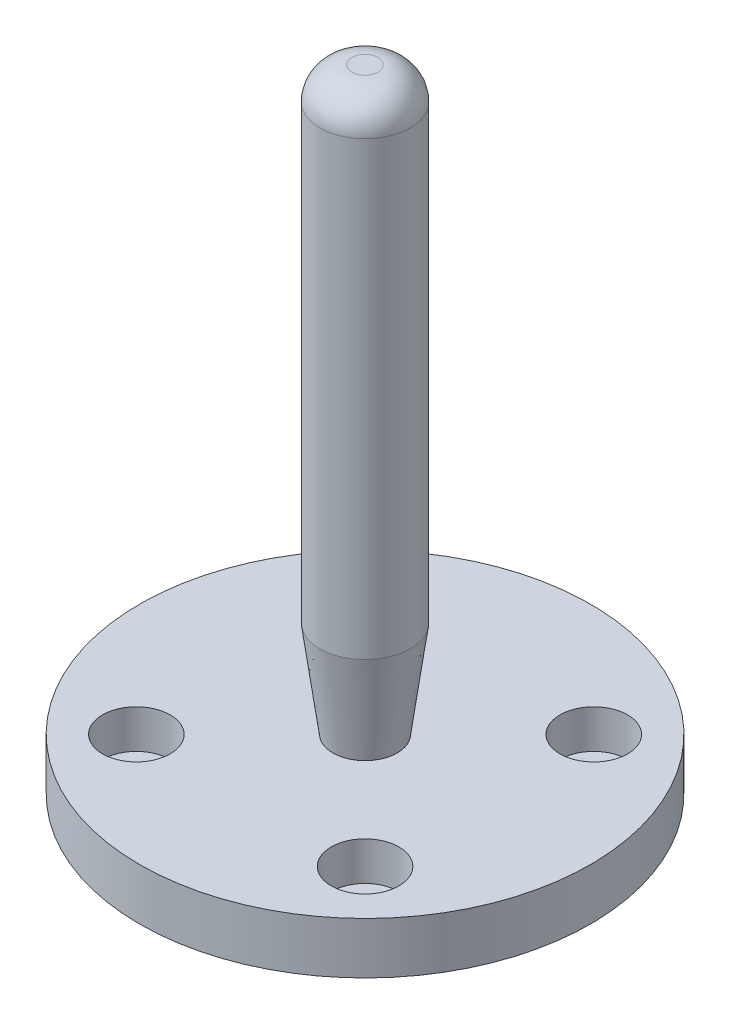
from build123d import *

# Parameters (mm, degrees)
SKETCH1_R           = 35
BOSS_EXTRUDE1_DEPTH = 8
SKETCH2_R           = 5.25
CUT_EXTRUDE1_DEPTH  = 6
SKETCH3_R           = 3.25
CUT_EXTRUDE2_DEPTH  = 2
FILLET2_R           = 5


with BuildPart() as part:
    # Sketch1 → Boss-Extrude1 (new body)
    with BuildSketch(Plane(origin=(0, 0, 0), x_dir=(1, 0, 0), z_dir=(0, 1, 0))):
        with Locations(Location((0, 0, 0), (0, 0, 270))):
            Circle(SKETCH1_R)
    extrude(amount=BOSS_EXTRUDE1_DEPTH)

    # Sketch2 → Cut-Extrude1 (cut)
    with BuildSketch(Plane(origin=(0, 8, 0), x_dir=(1, 0, 0), z_dir=(0, 1, 0))):
        with Locations(Location((-17.75, 17.75, 0), (0, 0, 270))):
            Circle(SKETCH2_R)
        with Locations(Location((17.75, 17.75, 0), (0, 0, 270))):
            Circle(SKETCH2_R)
        with Locations(Location((17.75, -17.75, 0), (0, 0, 270))):
            Circle(SKETCH2_R)
        with Locations(Location((-17.75, -17.75, 0), (0, 0, 270))):
            Circle(SKETCH2_R)
    extrude(amount=-CUT_EXTRUDE1_DEPTH, mode=Mode.SUBTRACT)

    # Sketch3 → Cut-Extrude2 (cut)
    with BuildSketch(Plane(origin=(0, 2, 0), x_dir=(1, 0, 0), z_dir=(0, 1, 0))):
        with Locations(Location((17.75, 17.75, 0), (0, 0, 270))):
            Circle(SKETCH3_R)
        with Locations(Location((-17.75, 17.75, 0), (0, 0, 270))):
            Circle(SKETCH3_R)
        with Locations(Location((-17.75, -17.75, 0), (0, 0, 270))):
            Circle(SKETCH3_R)
        with Locations(Location((17.75, -17.75, 0), (0, 0, 270))):
            Circle(SKETCH3_R)
    extrude(amount=-CUT_EXTRUDE2_DEPTH, mode=Mode.SUBTRACT)

    # Sketch4 → Revolve1 (revolve)
    with BuildSketch(Plane(origin=(0, 0, 0), x_dir=(0, 0, -1), z_dir=(1, 0, 0))):
        Polygon((0, 8), (0, 98), (7, 98), (7, 23), (5, 8), align=None)
    revolve(axis=Axis((0, 8, 0), (0, 1, 0)))

    # Fillet2
    fillet2_edges = [part.edges().sort_by_distance(p)[0] for p in [
        (0, 98, 7),
    ]]
    fillet(fillet2_edges, radius=FILLET2_R)


solid = part.part
